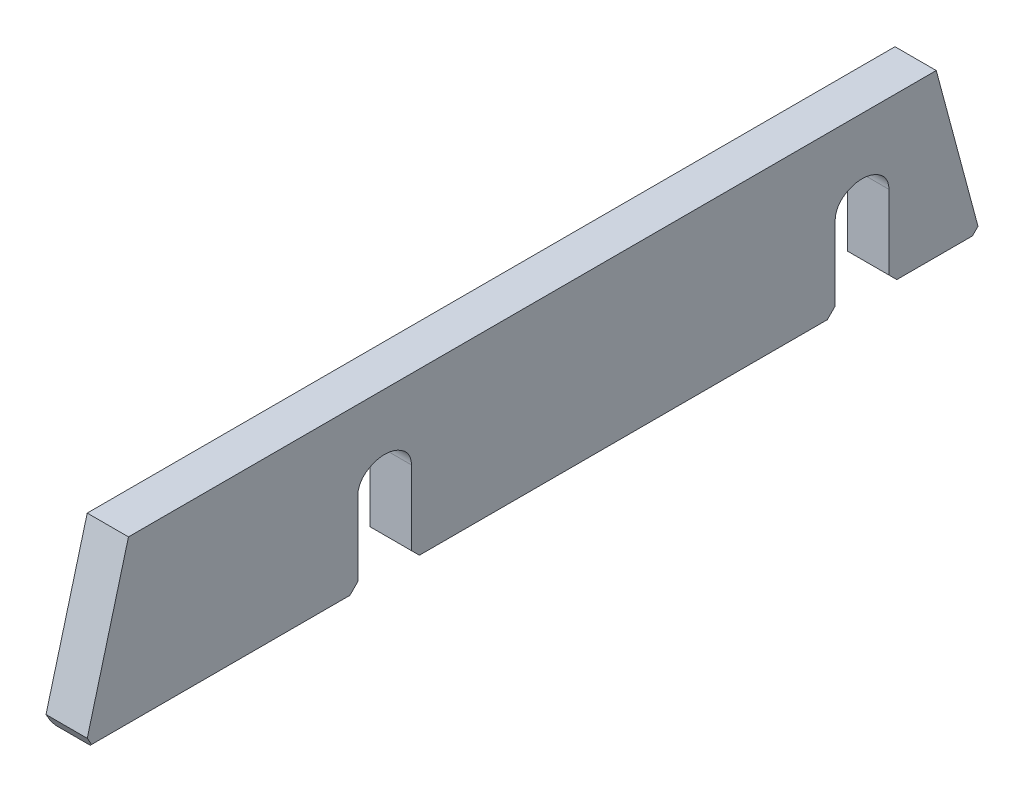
from build123d import *
from OCP.BRepFilletAPI import BRepFilletAPI_MakeChamfer

# Parameters (mm, degrees)
SKETCH2_W               = 810.995
SKETCH2_H               = 3979.45
BOSS_EXTRUDE1_DEPTH     = 101.6
CUT_EXTRUDE2_DEPTH      = 2034.16412474
CUT_EXTRUDE2_DEPTH_BACK = 2034.16412474
BOSS_EXTRUDE2_DEPTH     = 101.6
CHAMFER2_SIZE           = 16
CHAMFER3_SIZE           = 55
CHAMFER3_SIZE2          = 44.907311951


with BuildPart() as part:
    # Sketch2 → Boss-Extrude1 (new, symmetric)
    with BuildSketch(Plane.YZ):
        Rectangle(SKETCH2_W, SKETCH2_H)
    extrude(amount=BOSS_EXTRUDE1_DEPTH, both=True)

    # Sketch4 → Cut-Extrude2 (cut, two sides: drawn at the far end of the back side and taken through both)
    with BuildSketch(Plane.YZ.offset(-CUT_EXTRUDE2_DEPTH_BACK)):
        with BuildLine():
            Line((15.32465804, -1491.8985), (-405.4975, -1491.8985))
            Line((-405.4975, -1491.8985), (-405.4975, -1756.4625))
            Line((-405.4975, -1756.4625), (15.32465804, -1756.4625))
            ThreePointArc((15.32465804, -1756.4625), (58.953918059, -1746.442984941), (93.840297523, -1718.392253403))
            ThreePointArc((93.840297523, -1718.392253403), (126.52376813, -1624.1805), (93.840297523, -1529.968746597))
            ThreePointArc((93.840297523, -1529.968746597), (58.953918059, -1501.918015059), (15.32465804, -1491.8985))
        make_face()
        with BuildLine():
            Line((-405.4975, 860.1015), (15.32465804, 860.1015))
            ThreePointArc((15.32465804, 860.1015), (58.953918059, 850.081984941), (93.840297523, 822.031253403))
            ThreePointArc((93.840297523, 822.031253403), (126.52376813, 727.8195), (93.840297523, 633.607746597))
            ThreePointArc((93.840297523, 633.607746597), (58.953918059, 605.557015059), (15.32465804, 595.5375))
            Line((15.32465804, 595.5375), (-405.4975, 595.5375))
            Line((-405.4975, 595.5375), (-405.4975, 860.1015))
        make_face()
    extrude(amount=CUT_EXTRUDE2_DEPTH + CUT_EXTRUDE2_DEPTH_BACK, mode=Mode.SUBTRACT)

    # Sketch5 → Boss-Extrude2 (add, symmetric)
    with BuildSketch(Plane.YZ):
        Polygon((405.4975, 1989.725), (-405.4975, 2207.030455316), (-405.4975, 1989.725), align=None)
        Polygon((405.4975, -1989.725), (-405.4975, -2207.030455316), (-405.4975, -1989.725), align=None)
    extrude(amount=BOSS_EXTRUDE2_DEPTH, both=True)

    # Chamfer2
    chamfer2_edges = [part.edges().sort_by_distance(p)[0] for p in [
        (101.6, -405.4975, 1533.565977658),
        (-101.6, -405.4975, -448.1805),
        (-101.6, -405.4975, -1981.746477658),
        (101.6, -405.4975, -448.1805),
        (101.6, -405.4975, -1981.746477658),
        (-101.6, -405.4975, 1533.565977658),
    ]]
    chamfer(chamfer2_edges, length=CHAMFER2_SIZE)

    # Chamfer3: one chamfer whose edges measure the first distance from different faces: ONE call of the kernel's chamfer builder (chamfer() names one face for all edges)
    chamfer3_edges_1 = [part.edges().sort_by_distance(p)[0] for p in [
        (0, -405.4975, -2207.030455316),
    ]]
    chamfer3_side_1 = [part.faces().sort_by_distance(p)[0] for p in [
        (0, -405.4975, -1981.746477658),
    ]]
    chamfer3_edges_2 = [part.edges().sort_by_distance(p)[0] for p in [
        (0, -405.4975, -1756.4625),
        (0, -405.4975, -1491.8985),
        (0, -405.4975, 595.5375),
        (0, -405.4975, 860.1015),
    ]]
    chamfer3_edges_3 = [part.edges().sort_by_distance(p)[0] for p in [
        (0, -405.4975, 2207.030455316),
    ]]
    chamfer3_side_3 = [part.faces().sort_by_distance(p)[0] for p in [
        (0, 0.622603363, 2098.21090159),
    ]]
    chamfer3 = BRepFilletAPI_MakeChamfer(part.part.solid().wrapped)
    for e in chamfer3_edges_1:
        chamfer3.Add(CHAMFER3_SIZE, CHAMFER3_SIZE2, e.wrapped, chamfer3_side_1[0].wrapped)  # the first distance lies on this face
    for e in chamfer3_edges_2:
        chamfer3.Add(CHAMFER3_SIZE, e.wrapped)
    for e in chamfer3_edges_3:
        chamfer3.Add(CHAMFER3_SIZE, CHAMFER3_SIZE2, e.wrapped, chamfer3_side_3[0].wrapped)  # the first distance lies on this face
    add(Compound.cast(chamfer3.Shape()), mode=Mode.REPLACE)


solid = part.part
